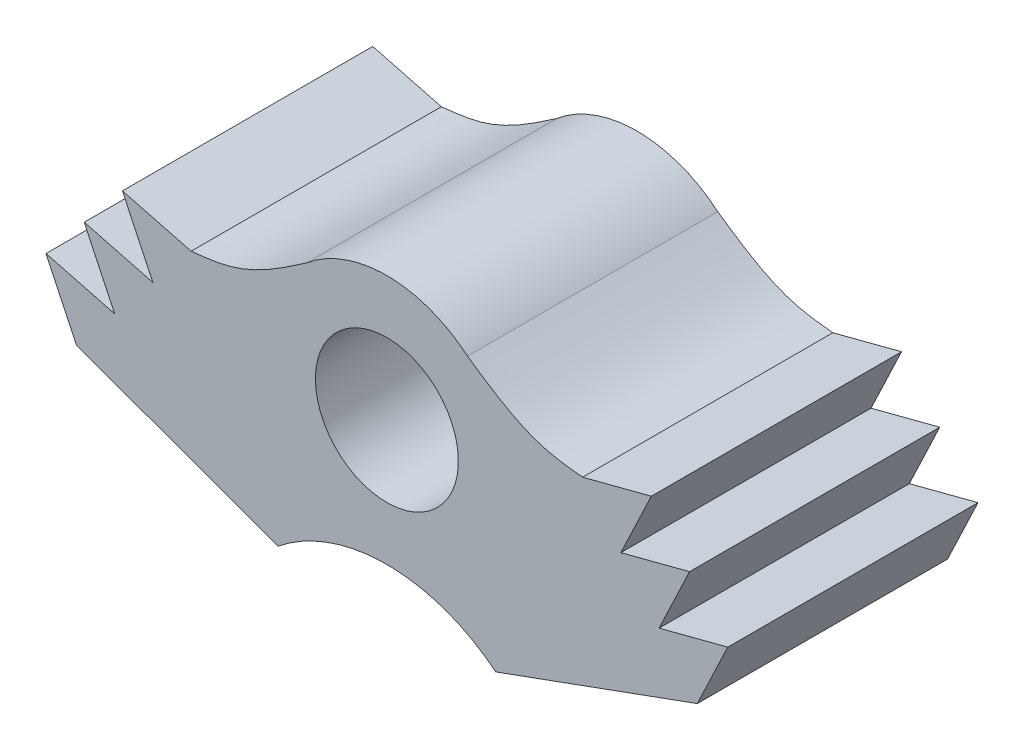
ISO-10303-21;
HEADER;
FILE_DESCRIPTION(('STEP AP214'),'2;1');
FILE_NAME('part.step','',(''),(''),'','','');
FILE_SCHEMA(('AUTOMOTIVE_DESIGN { 1 0 10303 214 1 1 1 1 }'));
ENDSEC;
DATA;
#1=APPLICATION_CONTEXT('core data for automotive mechanical design processes');
#2=APPLICATION_PROTOCOL_DEFINITION('international standard','automotive_design',2000,#1);
#3=PRODUCT_CONTEXT('',#1,'mechanical');
#4=PRODUCT('Part','Part','',(#3));
#5=PRODUCT_RELATED_PRODUCT_CATEGORY('part','',(#4));
#6=PRODUCT_DEFINITION_FORMATION('','',#4);
#7=PRODUCT_DEFINITION_CONTEXT('part definition',#1,'design');
#8=PRODUCT_DEFINITION('design','',#6,#7);
#9=PRODUCT_DEFINITION_SHAPE('','',#8);
#10=(LENGTH_UNIT() NAMED_UNIT(*) SI_UNIT(.MILLI.,.METRE.));
#11=(NAMED_UNIT(*) PLANE_ANGLE_UNIT() SI_UNIT($,.RADIAN.));
#12=(NAMED_UNIT(*) SI_UNIT($,.STERADIAN.) SOLID_ANGLE_UNIT());
#13=UNCERTAINTY_MEASURE_WITH_UNIT(LENGTH_MEASURE(1.E-05),#10,'distance_accuracy_value','');
#14=(GEOMETRIC_REPRESENTATION_CONTEXT(3) GLOBAL_UNCERTAINTY_ASSIGNED_CONTEXT((#13)) GLOBAL_UNIT_ASSIGNED_CONTEXT((#10,
#11,#12)) REPRESENTATION_CONTEXT('',''));
#15=CARTESIAN_POINT('',(0.,0.,0.));
#16=DIRECTION('',(0.,0.,1.));
#17=DIRECTION('',(1.,0.,0.));
#18=AXIS2_PLACEMENT_3D('',#15,#16,#17);
#19=CARTESIAN_POINT('',(0.,0.,7.));
#20=DIRECTION('',(0.,0.,1.));
#21=DIRECTION('',(1.,0.,0.));
#22=AXIS2_PLACEMENT_3D('',#19,#20,#21);
#23=PLANE('',#22);
#24=CARTESIAN_POINT('',(0.,0.,7.));
#25=DIRECTION('',(0.,0.,-1.));
#26=DIRECTION('',(1.,0.,0.));
#27=AXIS2_PLACEMENT_3D('',#24,#25,#26);
#28=CIRCLE('',#27,4.83630465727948);
#29=CARTESIAN_POINT('',(-3.04627929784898,3.75633134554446,7.));
#30=VERTEX_POINT('',#29);
#31=CARTESIAN_POINT('',(3.04627929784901,3.7563313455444,7.));
#32=VERTEX_POINT('',#31);
#33=EDGE_CURVE('E216',#30,#32,#28,.T.);
#34=ORIENTED_EDGE('',*,*,#33,.T.);
#35=DIRECTION('',(0.939692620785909,0.342020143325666,0.));
#36=VECTOR('',#35,1.);
#37=CARTESIAN_POINT('',(3.04627929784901,3.7563313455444,7.));
#38=LINE('',#37,#36);
#39=CARTESIAN_POINT('',(8.68443502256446,5.80845220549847,7.));
#40=VERTEX_POINT('',#39);
#41=EDGE_CURVE('E163',#32,#40,#38,.T.);
#42=ORIENTED_EDGE('',*,*,#41,.T.);
#43=DIRECTION('',(0.429064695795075,0.903273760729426,0.));
#44=VECTOR('',#43,1.);
#45=CARTESIAN_POINT('',(8.68443502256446,5.80845220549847,7.));
#46=LINE('',#45,#44);
#47=CARTESIAN_POINT('',(9.53645404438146,7.60213608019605,7.));
#48=VERTEX_POINT('',#47);
#49=EDGE_CURVE('E219',#40,#48,#46,.T.);
#50=ORIENTED_EDGE('',*,*,#49,.T.);
#51=DIRECTION('',(-0.967745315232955,-0.251930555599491,0.));
#52=VECTOR('',#51,1.);
#53=CARTESIAN_POINT('',(9.53645404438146,7.60213608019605,7.));
#54=LINE('',#53,#52);
#55=CARTESIAN_POINT('',(7.61474520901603,7.10186274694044,7.));
#56=VERTEX_POINT('',#55);
#57=EDGE_CURVE('E221',#48,#56,#54,.T.);
#58=ORIENTED_EDGE('',*,*,#57,.T.);
#59=DIRECTION('',(0.429064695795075,0.903273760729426,0.));
#60=VECTOR('',#59,1.);
#61=CARTESIAN_POINT('',(7.61474520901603,7.10186274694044,7.));
#62=LINE('',#61,#60);
#63=CARTESIAN_POINT('',(8.46676423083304,8.89554662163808,7.));
#64=VERTEX_POINT('',#63);
#65=EDGE_CURVE('E223',#56,#64,#62,.T.);
#66=ORIENTED_EDGE('',*,*,#65,.T.);
#67=DIRECTION('',(-0.967745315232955,-0.251930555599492,0.));
#68=VECTOR('',#67,1.);
#69=CARTESIAN_POINT('',(8.46676423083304,8.89554662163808,7.));
#70=LINE('',#69,#68);
#71=CARTESIAN_POINT('',(6.54505539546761,8.39527328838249,7.));
#72=VERTEX_POINT('',#71);
#73=EDGE_CURVE('E225',#64,#72,#70,.T.);
#74=ORIENTED_EDGE('',*,*,#73,.T.);
#75=DIRECTION('',(0.429064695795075,0.903273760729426,0.));
#76=VECTOR('',#75,1.);
#77=CARTESIAN_POINT('',(6.54505539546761,8.39527328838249,7.));
#78=LINE('',#77,#76);
#79=CARTESIAN_POINT('',(7.39707441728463,10.1889571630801,7.));
#80=VERTEX_POINT('',#79);
#81=EDGE_CURVE('E227',#72,#80,#78,.T.);
#82=ORIENTED_EDGE('',*,*,#81,.T.);
#83=DIRECTION('',(-0.967745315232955,-0.251930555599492,0.));
#84=VECTOR('',#83,1.);
#85=CARTESIAN_POINT('',(7.39707441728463,10.1889571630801,7.));
#86=LINE('',#85,#84);
#87=CARTESIAN_POINT('',(5.47536558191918,9.68868382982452,7.));
#88=VERTEX_POINT('',#87);
#89=EDGE_CURVE('E229',#80,#88,#86,.T.);
#90=ORIENTED_EDGE('',*,*,#89,.T.);
#91=CARTESIAN_POINT('',(5.47536558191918,9.68868382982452,7.));
#92=CARTESIAN_POINT('',(5.12775168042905,9.72572060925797,7.));
#93=CARTESIAN_POINT('',(3.9496177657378,9.85124575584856,7.));
#94=CARTESIAN_POINT('',(2.95621737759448,10.5322218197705,7.));
#95=CARTESIAN_POINT('',(2.2559244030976,11.012272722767,7.));
#96=B_SPLINE_CURVE_WITH_KNOTS('',3,(#91,#92,#93,#94,#95),.UNSPECIFIED.,.F.,.F.,(4,1,4),(0.,
0.295054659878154,1.),.UNSPECIFIED.);
#97=CARTESIAN_POINT('',(2.2559244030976,11.012272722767,7.));
#98=VERTEX_POINT('',#97);
#99=EDGE_CURVE('E231',#88,#98,#96,.T.);
#100=ORIENTED_EDGE('',*,*,#99,.T.);
#101=CARTESIAN_POINT('',(0.,8.33630465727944,7.));
#102=DIRECTION('',(0.,0.,1.));
#103=DIRECTION('',(1.,0.,0.));
#104=AXIS2_PLACEMENT_3D('',#101,#102,#103);
#105=CIRCLE('',#104,3.5);
#106=CARTESIAN_POINT('',(-2.25592440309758,11.0122727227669,7.));
#107=VERTEX_POINT('',#106);
#108=EDGE_CURVE('E236',#98,#107,#105,.T.);
#109=ORIENTED_EDGE('',*,*,#108,.T.);
#110=CARTESIAN_POINT('',(-2.25592440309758,11.0122727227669,7.));
#111=CARTESIAN_POINT('',(-2.95621737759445,10.5322218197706,7.));
#112=CARTESIAN_POINT('',(-3.94961776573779,9.85124575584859,7.));
#113=CARTESIAN_POINT('',(-5.12775168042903,9.72572060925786,7.));
#114=CARTESIAN_POINT('',(-5.47536558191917,9.68868382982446,7.));
#115=B_SPLINE_CURVE_WITH_KNOTS('',3,(#110,#111,#112,#113,#114),.UNSPECIFIED.,.F.,.F.,(4,1,4),
(0.,0.704945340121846,1.),.UNSPECIFIED.);
#116=CARTESIAN_POINT('',(-5.47536558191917,9.68868382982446,7.));
#117=VERTEX_POINT('',#116);
#118=EDGE_CURVE('E316',#107,#117,#115,.T.);
#119=ORIENTED_EDGE('',*,*,#118,.T.);
#120=DIRECTION('',(-0.967745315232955,0.251930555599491,0.));
#121=VECTOR('',#120,1.);
#122=CARTESIAN_POINT('',(-7.39707441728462,10.1889571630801,7.));
#123=LINE('',#122,#121);
#124=CARTESIAN_POINT('',(-7.39707441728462,10.1889571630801,7.));
#125=VERTEX_POINT('',#124);
#126=EDGE_CURVE('E321',#117,#125,#123,.T.);
#127=ORIENTED_EDGE('',*,*,#126,.T.);
#128=DIRECTION('',(0.429064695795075,-0.903273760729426,0.));
#129=VECTOR('',#128,1.);
#130=CARTESIAN_POINT('',(-6.5450553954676,8.39527328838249,7.));
#131=LINE('',#130,#129);
#132=CARTESIAN_POINT('',(-6.5450553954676,8.39527328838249,7.));
#133=VERTEX_POINT('',#132);
#134=EDGE_CURVE('E326',#125,#133,#131,.T.);
#135=ORIENTED_EDGE('',*,*,#134,.T.);
#136=DIRECTION('',(-0.967745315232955,0.251930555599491,0.));
#137=VECTOR('',#136,1.);
#138=CARTESIAN_POINT('',(-8.46676423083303,8.89554662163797,7.));
#139=LINE('',#138,#137);
#140=CARTESIAN_POINT('',(-8.46676423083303,8.89554662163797,7.));
#141=VERTEX_POINT('',#140);
#142=EDGE_CURVE('E328',#133,#141,#139,.T.);
#143=ORIENTED_EDGE('',*,*,#142,.T.);
#144=DIRECTION('',(0.429064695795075,-0.903273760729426,0.));
#145=VECTOR('',#144,1.);
#146=CARTESIAN_POINT('',(-7.61474520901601,7.10186274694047,7.));
#147=LINE('',#146,#145);
#148=CARTESIAN_POINT('',(-7.61474520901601,7.10186274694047,7.));
#149=VERTEX_POINT('',#148);
#150=EDGE_CURVE('E330',#141,#149,#147,.T.);
#151=ORIENTED_EDGE('',*,*,#150,.T.);
#152=DIRECTION('',(-0.967745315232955,0.251930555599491,0.));
#153=VECTOR('',#152,1.);
#154=CARTESIAN_POINT('',(-9.53645404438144,7.602136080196,7.));
#155=LINE('',#154,#153);
#156=CARTESIAN_POINT('',(-9.53645404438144,7.602136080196,7.));
#157=VERTEX_POINT('',#156);
#158=EDGE_CURVE('E332',#149,#157,#155,.T.);
#159=ORIENTED_EDGE('',*,*,#158,.T.);
#160=DIRECTION('',(0.429064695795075,-0.903273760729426,0.));
#161=VECTOR('',#160,1.);
#162=CARTESIAN_POINT('',(-8.68443502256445,5.80845220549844,7.));
#163=LINE('',#162,#161);
#164=CARTESIAN_POINT('',(-8.68443502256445,5.80845220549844,7.));
#165=VERTEX_POINT('',#164);
#166=EDGE_CURVE('E44',#157,#165,#163,.T.);
#167=ORIENTED_EDGE('',*,*,#166,.T.);
#168=DIRECTION('',(0.939692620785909,-0.342020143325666,0.));
#169=VECTOR('',#168,1.);
#170=CARTESIAN_POINT('',(-3.04627929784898,3.75633134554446,7.));
#171=LINE('',#170,#169);
#172=EDGE_CURVE('E39',#165,#30,#171,.T.);
#173=ORIENTED_EDGE('',*,*,#172,.T.);
#174=EDGE_LOOP('',(#34,#42,#50,#58,#66,#74,#82,#90,#100,#109,#119,#127,#135,#143,#151,#159,#167,#173));
#175=FACE_BOUND('',#174,.T.);
#176=CARTESIAN_POINT('',(0.,8.33630465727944,7.));
#177=DIRECTION('',(0.,0.,1.));
#178=DIRECTION('',(1.,0.,0.));
#179=AXIS2_PLACEMENT_3D('',#176,#177,#178);
#180=CIRCLE('',#179,2.);
#181=CARTESIAN_POINT('',(-1.99999999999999,8.33630465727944,7.));
#182=VERTEX_POINT('',#181);
#183=EDGE_CURVE('E168',#182,#182,#180,.T.);
#184=ORIENTED_EDGE('',*,*,#183,.F.);
#185=EDGE_LOOP('',(#184));
#186=FACE_BOUND('',#185,.T.);
#187=ADVANCED_FACE('F24',(#175,#186),#23,.T.);
#188=CARTESIAN_POINT('',(0.,0.,0.));
#189=DIRECTION('',(0.,0.,1.));
#190=DIRECTION('',(1.,0.,0.));
#191=AXIS2_PLACEMENT_3D('',#188,#189,#190);
#192=PLANE('',#191);
#193=CARTESIAN_POINT('',(0.,0.,0.));
#194=DIRECTION('',(0.,0.,-1.));
#195=DIRECTION('',(1.,0.,0.));
#196=AXIS2_PLACEMENT_3D('',#193,#194,#195);
#197=CIRCLE('',#196,4.83630465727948);
#198=CARTESIAN_POINT('',(-3.04627929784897,3.7563313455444,0.));
#199=VERTEX_POINT('',#198);
#200=CARTESIAN_POINT('',(3.046279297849,3.75633134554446,0.));
#201=VERTEX_POINT('',#200);
#202=EDGE_CURVE('E154',#199,#201,#197,.T.);
#203=ORIENTED_EDGE('',*,*,#202,.F.);
#204=DIRECTION('',(0.939692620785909,-0.342020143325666,0.));
#205=VECTOR('',#204,1.);
#206=CARTESIAN_POINT('',(-3.04627929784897,3.7563313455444,0.));
#207=LINE('',#206,#205);
#208=CARTESIAN_POINT('',(-8.68443502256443,5.80845220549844,0.));
#209=VERTEX_POINT('',#208);
#210=EDGE_CURVE('E214',#209,#199,#207,.T.);
#211=ORIENTED_EDGE('',*,*,#210,.F.);
#212=DIRECTION('',(0.429064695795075,-0.903273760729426,0.));
#213=VECTOR('',#212,1.);
#214=CARTESIAN_POINT('',(-8.68443502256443,5.80845220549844,0.));
#215=LINE('',#214,#213);
#216=CARTESIAN_POINT('',(-9.53645404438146,7.60213608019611,0.));
#217=VERTEX_POINT('',#216);
#218=EDGE_CURVE('E212',#217,#209,#215,.T.);
#219=ORIENTED_EDGE('',*,*,#218,.F.);
#220=DIRECTION('',(-0.967745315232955,0.251930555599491,0.));
#221=VECTOR('',#220,1.);
#222=CARTESIAN_POINT('',(-9.53645404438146,7.60213608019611,0.));
#223=LINE('',#222,#221);
#224=CARTESIAN_POINT('',(-7.61474520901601,7.1018627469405,0.));
#225=VERTEX_POINT('',#224);
#226=EDGE_CURVE('E210',#225,#217,#223,.T.);
#227=ORIENTED_EDGE('',*,*,#226,.F.);
#228=DIRECTION('',(0.429064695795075,-0.903273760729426,0.));
#229=VECTOR('',#228,1.);
#230=CARTESIAN_POINT('',(-7.61474520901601,7.1018627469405,0.));
#231=LINE('',#230,#229);
#232=CARTESIAN_POINT('',(-8.46676423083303,8.89554662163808,0.));
#233=VERTEX_POINT('',#232);
#234=EDGE_CURVE('E208',#233,#225,#231,.T.);
#235=ORIENTED_EDGE('',*,*,#234,.F.);
#236=DIRECTION('',(-0.967745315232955,0.251930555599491,0.));
#237=VECTOR('',#236,1.);
#238=CARTESIAN_POINT('',(-8.46676423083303,8.89554662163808,0.));
#239=LINE('',#238,#237);
#240=CARTESIAN_POINT('',(-6.5450553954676,8.39527328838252,0.));
#241=VERTEX_POINT('',#240);
#242=EDGE_CURVE('E206',#241,#233,#239,.T.);
#243=ORIENTED_EDGE('',*,*,#242,.F.);
#244=DIRECTION('',(0.429064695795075,-0.903273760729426,0.));
#245=VECTOR('',#244,1.);
#246=CARTESIAN_POINT('',(-6.5450553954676,8.39527328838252,0.));
#247=LINE('',#246,#245);
#248=CARTESIAN_POINT('',(-7.39707441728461,10.1889571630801,0.));
#249=VERTEX_POINT('',#248);
#250=EDGE_CURVE('E204',#249,#241,#247,.T.);
#251=ORIENTED_EDGE('',*,*,#250,.F.);
#252=DIRECTION('',(-0.967745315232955,0.251930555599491,0.));
#253=VECTOR('',#252,1.);
#254=CARTESIAN_POINT('',(-7.39707441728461,10.1889571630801,0.));
#255=LINE('',#254,#253);
#256=CARTESIAN_POINT('',(-5.47536558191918,9.68868382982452,0.));
#257=VERTEX_POINT('',#256);
#258=EDGE_CURVE('E199',#257,#249,#255,.T.);
#259=ORIENTED_EDGE('',*,*,#258,.F.);
#260=CARTESIAN_POINT('',(-2.25592440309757,11.0122727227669,0.));
#261=CARTESIAN_POINT('',(-2.95621737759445,10.5322218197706,0.));
#262=CARTESIAN_POINT('',(-3.94961776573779,9.85124575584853,0.));
#263=CARTESIAN_POINT('',(-5.12775168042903,9.72572060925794,0.));
#264=CARTESIAN_POINT('',(-5.47536558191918,9.68868382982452,0.));
#265=B_SPLINE_CURVE_WITH_KNOTS('',3,(#260,#261,#262,#263,#264),.UNSPECIFIED.,.F.,.F.,(4,1,4),
(0.,0.704945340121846,1.),.UNSPECIFIED.);
#266=CARTESIAN_POINT('',(-2.25592440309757,11.0122727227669,0.));
#267=VERTEX_POINT('',#266);
#268=EDGE_CURVE('E195',#267,#257,#265,.T.);
#269=ORIENTED_EDGE('',*,*,#268,.F.);
#270=CARTESIAN_POINT('',(0.,8.33630465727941,0.));
#271=DIRECTION('',(0.,0.,1.));
#272=DIRECTION('',(1.,0.,0.));
#273=AXIS2_PLACEMENT_3D('',#270,#271,#272);
#274=CIRCLE('',#273,3.5);
#275=CARTESIAN_POINT('',(2.25592440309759,11.0122727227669,0.));
#276=VERTEX_POINT('',#275);
#277=EDGE_CURVE('E190',#276,#267,#274,.T.);
#278=ORIENTED_EDGE('',*,*,#277,.F.);
#279=CARTESIAN_POINT('',(5.47536558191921,9.68868382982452,0.));
#280=CARTESIAN_POINT('',(5.12775168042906,9.72572060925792,0.));
#281=CARTESIAN_POINT('',(3.94961776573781,9.85124575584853,0.));
#282=CARTESIAN_POINT('',(2.95621737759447,10.5322218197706,0.));
#283=CARTESIAN_POINT('',(2.25592440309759,11.0122727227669,0.));
#284=B_SPLINE_CURVE_WITH_KNOTS('',3,(#279,#280,#281,#282,#283),.UNSPECIFIED.,.F.,.F.,(4,1,4),
(0.,0.295054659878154,1.),.UNSPECIFIED.);
#285=CARTESIAN_POINT('',(5.47536558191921,9.68868382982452,0.));
#286=VERTEX_POINT('',#285);
#287=EDGE_CURVE('E186',#286,#276,#284,.T.);
#288=ORIENTED_EDGE('',*,*,#287,.F.);
#289=DIRECTION('',(-0.967745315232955,-0.251930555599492,0.));
#290=VECTOR('',#289,1.);
#291=CARTESIAN_POINT('',(7.39707441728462,10.1889571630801,0.));
#292=LINE('',#291,#290);
#293=CARTESIAN_POINT('',(7.39707441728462,10.1889571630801,0.));
#294=VERTEX_POINT('',#293);
#295=EDGE_CURVE('E184',#294,#286,#292,.T.);
#296=ORIENTED_EDGE('',*,*,#295,.F.);
#297=DIRECTION('',(0.429064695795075,0.903273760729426,0.));
#298=VECTOR('',#297,1.);
#299=CARTESIAN_POINT('',(6.54505539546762,8.39527328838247,0.));
#300=LINE('',#299,#298);
#301=CARTESIAN_POINT('',(6.54505539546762,8.39527328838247,0.));
#302=VERTEX_POINT('',#301);
#303=EDGE_CURVE('E182',#302,#294,#300,.T.);
#304=ORIENTED_EDGE('',*,*,#303,.F.);
#305=DIRECTION('',(-0.967745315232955,-0.251930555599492,0.));
#306=VECTOR('',#305,1.);
#307=CARTESIAN_POINT('',(8.46676423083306,8.89554662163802,0.));
#308=LINE('',#307,#306);
#309=CARTESIAN_POINT('',(8.46676423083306,8.89554662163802,0.));
#310=VERTEX_POINT('',#309);
#311=EDGE_CURVE('E180',#310,#302,#308,.T.);
#312=ORIENTED_EDGE('',*,*,#311,.F.);
#313=DIRECTION('',(0.429064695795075,0.903273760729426,0.));
#314=VECTOR('',#313,1.);
#315=CARTESIAN_POINT('',(7.61474520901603,7.10186274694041,0.));
#316=LINE('',#315,#314);
#317=CARTESIAN_POINT('',(7.61474520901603,7.10186274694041,0.));
#318=VERTEX_POINT('',#317);
#319=EDGE_CURVE('E178',#318,#310,#316,.T.);
#320=ORIENTED_EDGE('',*,*,#319,.F.);
#321=DIRECTION('',(-0.967745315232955,-0.251930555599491,0.));
#322=VECTOR('',#321,1.);
#323=CARTESIAN_POINT('',(9.53645404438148,7.60213608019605,0.));
#324=LINE('',#323,#322);
#325=CARTESIAN_POINT('',(9.53645404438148,7.60213608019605,0.));
#326=VERTEX_POINT('',#325);
#327=EDGE_CURVE('E176',#326,#318,#324,.T.);
#328=ORIENTED_EDGE('',*,*,#327,.F.);
#329=DIRECTION('',(0.429064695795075,0.903273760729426,0.));
#330=VECTOR('',#329,1.);
#331=CARTESIAN_POINT('',(8.68443502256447,5.80845220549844,0.));
#332=LINE('',#331,#330);
#333=CARTESIAN_POINT('',(8.68443502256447,5.80845220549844,0.));
#334=VERTEX_POINT('',#333);
#335=EDGE_CURVE('E156',#334,#326,#332,.T.);
#336=ORIENTED_EDGE('',*,*,#335,.F.);
#337=DIRECTION('',(0.939692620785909,0.342020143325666,0.));
#338=VECTOR('',#337,1.);
#339=CARTESIAN_POINT('',(3.046279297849,3.75633134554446,0.));
#340=LINE('',#339,#338);
#341=EDGE_CURVE('E149',#201,#334,#340,.T.);
#342=ORIENTED_EDGE('',*,*,#341,.F.);
#343=EDGE_LOOP('',(#203,#211,#219,#227,#235,#243,#251,#259,#269,#278,#288,#296,#304,#312,#320,
#328,#336,#342));
#344=FACE_BOUND('',#343,.T.);
#345=CARTESIAN_POINT('',(0.,8.33630465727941,0.));
#346=DIRECTION('',(0.,0.,1.));
#347=DIRECTION('',(1.,0.,0.));
#348=AXIS2_PLACEMENT_3D('',#345,#346,#347);
#349=CIRCLE('',#348,2.);
#350=CARTESIAN_POINT('',(-1.99999999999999,8.33630465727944,0.));
#351=VERTEX_POINT('',#350);
#352=EDGE_CURVE('E171',#351,#351,#349,.T.);
#353=ORIENTED_EDGE('',*,*,#352,.T.);
#354=EDGE_LOOP('',(#353));
#355=FACE_BOUND('',#354,.T.);
#356=ADVANCED_FACE('F150',(#344,#355),#192,.F.);
#357=CARTESIAN_POINT('',(0.,0.,7.));
#358=DIRECTION('',(0.,0.,-1.));
#359=DIRECTION('',(-1.,0.,0.));
#360=AXIS2_PLACEMENT_3D('',#357,#358,#359);
#361=CYLINDRICAL_SURFACE('',#360,4.83630465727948);
#362=ORIENTED_EDGE('',*,*,#202,.T.);
#363=DIRECTION('',(0.,0.,-1.));
#364=VECTOR('',#363,1.);
#365=CARTESIAN_POINT('',(3.04627929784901,3.7563313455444,7.));
#366=LINE('',#365,#364);
#367=EDGE_CURVE('E11',#32,#201,#366,.T.);
#368=ORIENTED_EDGE('',*,*,#367,.F.);
#369=ORIENTED_EDGE('',*,*,#33,.F.);
#370=DIRECTION('',(0.,0.,-1.));
#371=VECTOR('',#370,1.);
#372=CARTESIAN_POINT('',(-3.04627929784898,3.75633134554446,7.));
#373=LINE('',#372,#371);
#374=EDGE_CURVE('E167',#30,#199,#373,.T.);
#375=ORIENTED_EDGE('',*,*,#374,.T.);
#376=EDGE_LOOP('',(#362,#368,#369,#375));
#377=FACE_BOUND('',#376,.T.);
#378=ADVANCED_FACE('F26',(#377),#361,.F.);
#379=CARTESIAN_POINT('',(3.04627929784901,3.7563313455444,7.));
#380=DIRECTION('',(-0.342020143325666,0.939692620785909,0.));
#381=DIRECTION('',(-0.939692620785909,-0.342020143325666,0.));
#382=AXIS2_PLACEMENT_3D('',#379,#380,#381);
#383=PLANE('',#382);
#384=ORIENTED_EDGE('',*,*,#341,.T.);
#385=DIRECTION('',(0.,0.,-1.));
#386=VECTOR('',#385,1.);
#387=CARTESIAN_POINT('',(8.68443502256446,5.80845220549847,7.));
#388=LINE('',#387,#386);
#389=EDGE_CURVE('E32',#40,#334,#388,.T.);
#390=ORIENTED_EDGE('',*,*,#389,.F.);
#391=ORIENTED_EDGE('',*,*,#41,.F.);
#392=ORIENTED_EDGE('',*,*,#367,.T.);
#393=EDGE_LOOP('',(#384,#390,#391,#392));
#394=FACE_BOUND('',#393,.T.);
#395=ADVANCED_FACE('F162',(#394),#383,.F.);
#396=CARTESIAN_POINT('',(8.68443502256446,5.80845220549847,7.));
#397=DIRECTION('',(-0.903273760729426,0.429064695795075,0.));
#398=DIRECTION('',(-0.429064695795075,-0.903273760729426,0.));
#399=AXIS2_PLACEMENT_3D('',#396,#397,#398);
#400=PLANE('',#399);
#401=ORIENTED_EDGE('',*,*,#335,.T.);
#402=DIRECTION('',(0.,0.,-1.));
#403=VECTOR('',#402,1.);
#404=CARTESIAN_POINT('',(9.53645404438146,7.60213608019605,7.));
#405=LINE('',#404,#403);
#406=EDGE_CURVE('E379',#48,#326,#405,.T.);
#407=ORIENTED_EDGE('',*,*,#406,.F.);
#408=ORIENTED_EDGE('',*,*,#49,.F.);
#409=ORIENTED_EDGE('',*,*,#389,.T.);
#410=EDGE_LOOP('',(#401,#407,#408,#409));
#411=FACE_BOUND('',#410,.T.);
#412=ADVANCED_FACE('F268',(#411),#400,.F.);
#413=CARTESIAN_POINT('',(9.53645404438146,7.60213608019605,7.));
#414=DIRECTION('',(0.251930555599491,-0.967745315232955,0.));
#415=DIRECTION('',(0.967745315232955,0.251930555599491,0.));
#416=AXIS2_PLACEMENT_3D('',#413,#414,#415);
#417=PLANE('',#416);
#418=ORIENTED_EDGE('',*,*,#327,.T.);
#419=DIRECTION('',(0.,0.,-1.));
#420=VECTOR('',#419,1.);
#421=CARTESIAN_POINT('',(7.61474520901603,7.10186274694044,7.));
#422=LINE('',#421,#420);
#423=EDGE_CURVE('E376',#56,#318,#422,.T.);
#424=ORIENTED_EDGE('',*,*,#423,.F.);
#425=ORIENTED_EDGE('',*,*,#57,.F.);
#426=ORIENTED_EDGE('',*,*,#406,.T.);
#427=EDGE_LOOP('',(#418,#424,#425,#426));
#428=FACE_BOUND('',#427,.T.);
#429=ADVANCED_FACE('F264',(#428),#417,.F.);
#430=CARTESIAN_POINT('',(7.61474520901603,7.10186274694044,7.));
#431=DIRECTION('',(-0.903273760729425,0.429064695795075,0.));
#432=DIRECTION('',(-0.429064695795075,-0.903273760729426,0.));
#433=AXIS2_PLACEMENT_3D('',#430,#431,#432);
#434=PLANE('',#433);
#435=ORIENTED_EDGE('',*,*,#319,.T.);
#436=DIRECTION('',(0.,0.,-1.));
#437=VECTOR('',#436,1.);
#438=CARTESIAN_POINT('',(8.46676423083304,8.89554662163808,7.));
#439=LINE('',#438,#437);
#440=EDGE_CURVE('E373',#64,#310,#439,.T.);
#441=ORIENTED_EDGE('',*,*,#440,.F.);
#442=ORIENTED_EDGE('',*,*,#65,.F.);
#443=ORIENTED_EDGE('',*,*,#423,.T.);
#444=EDGE_LOOP('',(#435,#441,#442,#443));
#445=FACE_BOUND('',#444,.T.);
#446=ADVANCED_FACE('F260',(#445),#434,.F.);
#447=CARTESIAN_POINT('',(8.46676423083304,8.89554662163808,7.));
#448=DIRECTION('',(0.251930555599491,-0.967745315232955,0.));
#449=DIRECTION('',(0.967745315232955,0.251930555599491,0.));
#450=AXIS2_PLACEMENT_3D('',#447,#448,#449);
#451=PLANE('',#450);
#452=ORIENTED_EDGE('',*,*,#311,.T.);
#453=DIRECTION('',(0.,0.,-1.));
#454=VECTOR('',#453,1.);
#455=CARTESIAN_POINT('',(6.54505539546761,8.39527328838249,7.));
#456=LINE('',#455,#454);
#457=EDGE_CURVE('E370',#72,#302,#456,.T.);
#458=ORIENTED_EDGE('',*,*,#457,.F.);
#459=ORIENTED_EDGE('',*,*,#73,.F.);
#460=ORIENTED_EDGE('',*,*,#440,.T.);
#461=EDGE_LOOP('',(#452,#458,#459,#460));
#462=FACE_BOUND('',#461,.T.);
#463=ADVANCED_FACE('F256',(#462),#451,.F.);
#464=CARTESIAN_POINT('',(6.54505539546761,8.39527328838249,7.));
#465=DIRECTION('',(-0.903273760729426,0.429064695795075,0.));
#466=DIRECTION('',(-0.429064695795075,-0.903273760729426,0.));
#467=AXIS2_PLACEMENT_3D('',#464,#465,#466);
#468=PLANE('',#467);
#469=ORIENTED_EDGE('',*,*,#303,.T.);
#470=DIRECTION('',(0.,0.,-1.));
#471=VECTOR('',#470,1.);
#472=CARTESIAN_POINT('',(7.39707441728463,10.1889571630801,7.));
#473=LINE('',#472,#471);
#474=EDGE_CURVE('E367',#80,#294,#473,.T.);
#475=ORIENTED_EDGE('',*,*,#474,.F.);
#476=ORIENTED_EDGE('',*,*,#81,.F.);
#477=ORIENTED_EDGE('',*,*,#457,.T.);
#478=EDGE_LOOP('',(#469,#475,#476,#477));
#479=FACE_BOUND('',#478,.T.);
#480=ADVANCED_FACE('F252',(#479),#468,.F.);
#481=CARTESIAN_POINT('',(7.39707441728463,10.1889571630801,7.));
#482=DIRECTION('',(0.251930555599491,-0.967745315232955,0.));
#483=DIRECTION('',(0.967745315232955,0.251930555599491,0.));
#484=AXIS2_PLACEMENT_3D('',#481,#482,#483);
#485=PLANE('',#484);
#486=ORIENTED_EDGE('',*,*,#295,.T.);
#487=DIRECTION('',(0.,0.,-1.));
#488=VECTOR('',#487,1.);
#489=CARTESIAN_POINT('',(5.47536558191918,9.68868382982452,7.));
#490=LINE('',#489,#488);
#491=EDGE_CURVE('E364',#88,#286,#490,.T.);
#492=ORIENTED_EDGE('',*,*,#491,.F.);
#493=ORIENTED_EDGE('',*,*,#89,.F.);
#494=ORIENTED_EDGE('',*,*,#474,.T.);
#495=EDGE_LOOP('',(#486,#492,#493,#494));
#496=FACE_BOUND('',#495,.T.);
#497=ADVANCED_FACE('F247',(#496),#485,.F.);
#498=DIRECTION('',(0.,0.,-1.));
#499=VECTOR('',#498,1.);
#500=SURFACE_OF_LINEAR_EXTRUSION('',#96,#499);
#501=ORIENTED_EDGE('',*,*,#287,.T.);
#502=DIRECTION('',(0.,0.,-1.));
#503=VECTOR('',#502,1.);
#504=CARTESIAN_POINT('',(2.2559244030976,11.012272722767,7.));
#505=LINE('',#504,#503);
#506=EDGE_CURVE('E361',#98,#276,#505,.T.);
#507=ORIENTED_EDGE('',*,*,#506,.F.);
#508=ORIENTED_EDGE('',*,*,#99,.F.);
#509=ORIENTED_EDGE('',*,*,#491,.T.);
#510=EDGE_LOOP('',(#501,#507,#508,#509));
#511=FACE_BOUND('',#510,.T.);
#512=ADVANCED_FACE('F242',(#511),#500,.F.);
#513=CARTESIAN_POINT('',(0.,8.33630465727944,7.));
#514=DIRECTION('',(0.,0.,-1.));
#515=DIRECTION('',(-1.,0.,0.));
#516=AXIS2_PLACEMENT_3D('',#513,#514,#515);
#517=CYLINDRICAL_SURFACE('',#516,3.5);
#518=ORIENTED_EDGE('',*,*,#277,.T.);
#519=DIRECTION('',(0.,0.,-1.));
#520=VECTOR('',#519,1.);
#521=CARTESIAN_POINT('',(-2.25592440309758,11.0122727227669,7.));
#522=LINE('',#521,#520);
#523=EDGE_CURVE('E358',#107,#267,#522,.T.);
#524=ORIENTED_EDGE('',*,*,#523,.F.);
#525=ORIENTED_EDGE('',*,*,#108,.F.);
#526=ORIENTED_EDGE('',*,*,#506,.T.);
#527=EDGE_LOOP('',(#518,#524,#525,#526));
#528=FACE_BOUND('',#527,.T.);
#529=ADVANCED_FACE('F246',(#528),#517,.T.);
#530=DIRECTION('',(0.,0.,-1.));
#531=VECTOR('',#530,1.);
#532=SURFACE_OF_LINEAR_EXTRUSION('',#115,#531);
#533=ORIENTED_EDGE('',*,*,#268,.T.);
#534=DIRECTION('',(0.,0.,-1.));
#535=VECTOR('',#534,1.);
#536=CARTESIAN_POINT('',(-5.47536558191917,9.68868382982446,7.));
#537=LINE('',#536,#535);
#538=EDGE_CURVE('E355',#117,#257,#537,.T.);
#539=ORIENTED_EDGE('',*,*,#538,.F.);
#540=ORIENTED_EDGE('',*,*,#118,.F.);
#541=ORIENTED_EDGE('',*,*,#523,.T.);
#542=EDGE_LOOP('',(#533,#539,#540,#541));
#543=FACE_BOUND('',#542,.T.);
#544=ADVANCED_FACE('F312',(#543),#532,.F.);
#545=CARTESIAN_POINT('',(-7.39707441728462,10.1889571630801,7.));
#546=DIRECTION('',(-0.251930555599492,-0.967745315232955,0.));
#547=DIRECTION('',(0.967745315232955,-0.251930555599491,0.));
#548=AXIS2_PLACEMENT_3D('',#545,#546,#547);
#549=PLANE('',#548);
#550=ORIENTED_EDGE('',*,*,#258,.T.);
#551=DIRECTION('',(0.,0.,-1.));
#552=VECTOR('',#551,1.);
#553=CARTESIAN_POINT('',(-7.39707441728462,10.1889571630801,7.));
#554=LINE('',#553,#552);
#555=EDGE_CURVE('E352',#125,#249,#554,.T.);
#556=ORIENTED_EDGE('',*,*,#555,.F.);
#557=ORIENTED_EDGE('',*,*,#126,.F.);
#558=ORIENTED_EDGE('',*,*,#538,.T.);
#559=EDGE_LOOP('',(#550,#556,#557,#558));
#560=FACE_BOUND('',#559,.T.);
#561=ADVANCED_FACE('F309',(#560),#549,.F.);
#562=CARTESIAN_POINT('',(-6.5450553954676,8.39527328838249,7.));
#563=DIRECTION('',(0.903273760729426,0.429064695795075,0.));
#564=DIRECTION('',(-0.429064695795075,0.903273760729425,0.));
#565=AXIS2_PLACEMENT_3D('',#562,#563,#564);
#566=PLANE('',#565);
#567=ORIENTED_EDGE('',*,*,#250,.T.);
#568=DIRECTION('',(0.,0.,-1.));
#569=VECTOR('',#568,1.);
#570=CARTESIAN_POINT('',(-6.5450553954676,8.39527328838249,7.));
#571=LINE('',#570,#569);
#572=EDGE_CURVE('E349',#133,#241,#571,.T.);
#573=ORIENTED_EDGE('',*,*,#572,.F.);
#574=ORIENTED_EDGE('',*,*,#134,.F.);
#575=ORIENTED_EDGE('',*,*,#555,.T.);
#576=EDGE_LOOP('',(#567,#573,#574,#575));
#577=FACE_BOUND('',#576,.T.);
#578=ADVANCED_FACE('F305',(#577),#566,.F.);
#579=CARTESIAN_POINT('',(-8.46676423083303,8.89554662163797,7.));
#580=DIRECTION('',(-0.251930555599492,-0.967745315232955,0.));
#581=DIRECTION('',(0.967745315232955,-0.251930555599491,0.));
#582=AXIS2_PLACEMENT_3D('',#579,#580,#581);
#583=PLANE('',#582);
#584=ORIENTED_EDGE('',*,*,#242,.T.);
#585=DIRECTION('',(0.,0.,-1.));
#586=VECTOR('',#585,1.);
#587=CARTESIAN_POINT('',(-8.46676423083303,8.89554662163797,7.));
#588=LINE('',#587,#586);
#589=EDGE_CURVE('E346',#141,#233,#588,.T.);
#590=ORIENTED_EDGE('',*,*,#589,.F.);
#591=ORIENTED_EDGE('',*,*,#142,.F.);
#592=ORIENTED_EDGE('',*,*,#572,.T.);
#593=EDGE_LOOP('',(#584,#590,#591,#592));
#594=FACE_BOUND('',#593,.T.);
#595=ADVANCED_FACE('F301',(#594),#583,.F.);
#596=CARTESIAN_POINT('',(-7.61474520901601,7.10186274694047,7.));
#597=DIRECTION('',(0.903273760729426,0.429064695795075,0.));
#598=DIRECTION('',(-0.429064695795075,0.903273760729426,0.));
#599=AXIS2_PLACEMENT_3D('',#596,#597,#598);
#600=PLANE('',#599);
#601=ORIENTED_EDGE('',*,*,#234,.T.);
#602=DIRECTION('',(0.,0.,-1.));
#603=VECTOR('',#602,1.);
#604=CARTESIAN_POINT('',(-7.61474520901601,7.10186274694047,7.));
#605=LINE('',#604,#603);
#606=EDGE_CURVE('E343',#149,#225,#605,.T.);
#607=ORIENTED_EDGE('',*,*,#606,.F.);
#608=ORIENTED_EDGE('',*,*,#150,.F.);
#609=ORIENTED_EDGE('',*,*,#589,.T.);
#610=EDGE_LOOP('',(#601,#607,#608,#609));
#611=FACE_BOUND('',#610,.T.);
#612=ADVANCED_FACE('F297',(#611),#600,.F.);
#613=CARTESIAN_POINT('',(-9.53645404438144,7.602136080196,7.));
#614=DIRECTION('',(-0.251930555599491,-0.967745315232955,0.));
#615=DIRECTION('',(0.967745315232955,-0.251930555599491,0.));
#616=AXIS2_PLACEMENT_3D('',#613,#614,#615);
#617=PLANE('',#616);
#618=ORIENTED_EDGE('',*,*,#226,.T.);
#619=DIRECTION('',(0.,0.,-1.));
#620=VECTOR('',#619,1.);
#621=CARTESIAN_POINT('',(-9.53645404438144,7.602136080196,7.));
#622=LINE('',#621,#620);
#623=EDGE_CURVE('E340',#157,#217,#622,.T.);
#624=ORIENTED_EDGE('',*,*,#623,.F.);
#625=ORIENTED_EDGE('',*,*,#158,.F.);
#626=ORIENTED_EDGE('',*,*,#606,.T.);
#627=EDGE_LOOP('',(#618,#624,#625,#626));
#628=FACE_BOUND('',#627,.T.);
#629=ADVANCED_FACE('F293',(#628),#617,.F.);
#630=CARTESIAN_POINT('',(-8.68443502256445,5.80845220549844,7.));
#631=DIRECTION('',(0.903273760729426,0.429064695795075,0.));
#632=DIRECTION('',(-0.429064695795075,0.903273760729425,0.));
#633=AXIS2_PLACEMENT_3D('',#630,#631,#632);
#634=PLANE('',#633);
#635=ORIENTED_EDGE('',*,*,#218,.T.);
#636=DIRECTION('',(0.,0.,-1.));
#637=VECTOR('',#636,1.);
#638=CARTESIAN_POINT('',(-8.68443502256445,5.80845220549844,7.));
#639=LINE('',#638,#637);
#640=EDGE_CURVE('E337',#165,#209,#639,.T.);
#641=ORIENTED_EDGE('',*,*,#640,.F.);
#642=ORIENTED_EDGE('',*,*,#166,.F.);
#643=ORIENTED_EDGE('',*,*,#623,.T.);
#644=EDGE_LOOP('',(#635,#641,#642,#643));
#645=FACE_BOUND('',#644,.T.);
#646=ADVANCED_FACE('F289',(#645),#634,.F.);
#647=CARTESIAN_POINT('',(-3.04627929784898,3.75633134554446,7.));
#648=DIRECTION('',(0.342020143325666,0.939692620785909,0.));
#649=DIRECTION('',(-0.939692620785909,0.342020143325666,0.));
#650=AXIS2_PLACEMENT_3D('',#647,#648,#649);
#651=PLANE('',#650);
#652=ORIENTED_EDGE('',*,*,#210,.T.);
#653=ORIENTED_EDGE('',*,*,#374,.F.);
#654=ORIENTED_EDGE('',*,*,#172,.F.);
#655=ORIENTED_EDGE('',*,*,#640,.T.);
#656=EDGE_LOOP('',(#652,#653,#654,#655));
#657=FACE_BOUND('',#656,.T.);
#658=ADVANCED_FACE('F285',(#657),#651,.F.);
#659=CARTESIAN_POINT('',(0.,8.33630465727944,7.));
#660=DIRECTION('',(0.,0.,-1.));
#661=DIRECTION('',(-1.,0.,0.));
#662=AXIS2_PLACEMENT_3D('',#659,#660,#661);
#663=CYLINDRICAL_SURFACE('',#662,2.);
#664=CARTESIAN_POINT('',(-1.99999999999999,8.33630465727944,7.));
#665=CARTESIAN_POINT('',(-1.99999999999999,8.33630465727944,6.92708333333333));
#666=CARTESIAN_POINT('',(-1.99999999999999,8.33630465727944,6.85416666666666));
#667=CARTESIAN_POINT('',(-1.99999999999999,8.33630465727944,6.70833333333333));
#668=CARTESIAN_POINT('',(-1.99999999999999,8.33630465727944,6.63541666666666));
#669=CARTESIAN_POINT('',(-1.99999999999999,8.33630465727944,6.48958333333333));
#670=CARTESIAN_POINT('',(-1.99999999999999,8.33630465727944,6.41666666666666));
#671=CARTESIAN_POINT('',(-1.99999999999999,8.33630465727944,6.27083333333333));
#672=CARTESIAN_POINT('',(-1.99999999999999,8.33630465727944,6.19791666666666));
#673=CARTESIAN_POINT('',(-1.99999999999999,8.33630465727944,6.05208333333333));
#674=CARTESIAN_POINT('',(-1.99999999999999,8.33630465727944,5.97916666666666));
#675=CARTESIAN_POINT('',(-1.99999999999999,8.33630465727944,5.83333333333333));
#676=CARTESIAN_POINT('',(-1.99999999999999,8.33630465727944,5.76041666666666));
#677=CARTESIAN_POINT('',(-1.99999999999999,8.33630465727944,5.61458333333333));
#678=CARTESIAN_POINT('',(-1.99999999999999,8.33630465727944,5.54166666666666));
#679=CARTESIAN_POINT('',(-1.99999999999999,8.33630465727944,5.39583333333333));
#680=CARTESIAN_POINT('',(-1.99999999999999,8.33630465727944,5.32291666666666));
#681=CARTESIAN_POINT('',(-1.99999999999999,8.33630465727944,5.17708333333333));
#682=CARTESIAN_POINT('',(-1.99999999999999,8.33630465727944,5.10416666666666));
#683=CARTESIAN_POINT('',(-1.99999999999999,8.33630465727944,4.95833333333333));
#684=CARTESIAN_POINT('',(-1.99999999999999,8.33630465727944,4.88541666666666));
#685=CARTESIAN_POINT('',(-1.99999999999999,8.33630465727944,4.73958333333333));
#686=CARTESIAN_POINT('',(-1.99999999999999,8.33630465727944,4.66666666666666));
#687=CARTESIAN_POINT('',(-1.99999999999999,8.33630465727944,4.52083333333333));
#688=CARTESIAN_POINT('',(-1.99999999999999,8.33630465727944,4.44791666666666));
#689=CARTESIAN_POINT('',(-1.99999999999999,8.33630465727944,4.30208333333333));
#690=CARTESIAN_POINT('',(-1.99999999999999,8.33630465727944,4.22916666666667));
#691=CARTESIAN_POINT('',(-1.99999999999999,8.33630465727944,4.08333333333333));
#692=CARTESIAN_POINT('',(-1.99999999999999,8.33630465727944,4.01041666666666));
#693=CARTESIAN_POINT('',(-1.99999999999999,8.33630465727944,3.86458333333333));
#694=CARTESIAN_POINT('',(-1.99999999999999,8.33630465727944,3.79166666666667));
#695=CARTESIAN_POINT('',(-1.99999999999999,8.33630465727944,3.64583333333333));
#696=CARTESIAN_POINT('',(-1.99999999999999,8.33630465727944,3.57291666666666));
#697=CARTESIAN_POINT('',(-1.99999999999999,8.33630465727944,3.42708333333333));
#698=CARTESIAN_POINT('',(-1.99999999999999,8.33630465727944,3.35416666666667));
#699=CARTESIAN_POINT('',(-1.99999999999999,8.33630465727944,3.20833333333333));
#700=CARTESIAN_POINT('',(-1.99999999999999,8.33630465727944,3.13541666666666));
#701=CARTESIAN_POINT('',(-1.99999999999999,8.33630465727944,2.98958333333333));
#702=CARTESIAN_POINT('',(-1.99999999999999,8.33630465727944,2.91666666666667));
#703=CARTESIAN_POINT('',(-1.99999999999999,8.33630465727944,2.77083333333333));
#704=CARTESIAN_POINT('',(-1.99999999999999,8.33630465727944,2.69791666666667));
#705=CARTESIAN_POINT('',(-1.99999999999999,8.33630465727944,2.55208333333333));
#706=CARTESIAN_POINT('',(-1.99999999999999,8.33630465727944,2.47916666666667));
#707=CARTESIAN_POINT('',(-1.99999999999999,8.33630465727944,2.33333333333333));
#708=CARTESIAN_POINT('',(-1.99999999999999,8.33630465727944,2.26041666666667));
#709=CARTESIAN_POINT('',(-1.99999999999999,8.33630465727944,2.11458333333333));
#710=CARTESIAN_POINT('',(-1.99999999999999,8.33630465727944,2.04166666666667));
#711=CARTESIAN_POINT('',(-1.99999999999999,8.33630465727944,1.89583333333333));
#712=CARTESIAN_POINT('',(-1.99999999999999,8.33630465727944,1.82291666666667));
#713=CARTESIAN_POINT('',(-1.99999999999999,8.33630465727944,1.67708333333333));
#714=CARTESIAN_POINT('',(-1.99999999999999,8.33630465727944,1.60416666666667));
#715=CARTESIAN_POINT('',(-1.99999999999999,8.33630465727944,1.45833333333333));
#716=CARTESIAN_POINT('',(-1.99999999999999,8.33630465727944,1.38541666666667));
#717=CARTESIAN_POINT('',(-1.99999999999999,8.33630465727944,1.23958333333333));
#718=CARTESIAN_POINT('',(-1.99999999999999,8.33630465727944,1.16666666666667));
#719=CARTESIAN_POINT('',(-1.99999999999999,8.33630465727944,1.02083333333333));
#720=CARTESIAN_POINT('',(-1.99999999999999,8.33630465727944,0.947916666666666));
#721=CARTESIAN_POINT('',(-1.99999999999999,8.33630465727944,0.802083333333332));
#722=CARTESIAN_POINT('',(-1.99999999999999,8.33630465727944,0.729166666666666));
#723=CARTESIAN_POINT('',(-1.99999999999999,8.33630465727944,0.583333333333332));
#724=CARTESIAN_POINT('',(-1.99999999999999,8.33630465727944,0.510416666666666));
#725=CARTESIAN_POINT('',(-1.99999999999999,8.33630465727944,0.364583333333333));
#726=CARTESIAN_POINT('',(-1.99999999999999,8.33630465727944,0.291666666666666));
#727=CARTESIAN_POINT('',(-1.99999999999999,8.33630465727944,0.145833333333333));
#728=CARTESIAN_POINT('',(-1.99999999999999,8.33630465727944,0.0729166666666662));
#729=CARTESIAN_POINT('',(-1.99999999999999,8.33630465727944,0.));
#730=B_SPLINE_CURVE_WITH_KNOTS('',3,(#664,#665,#666,#667,#668,#669,#670,#671,#672,#673,#674,
#675,#676,#677,#678,#679,#680,#681,#682,#683,#684,#685,#686,#687,#688,#689,#690,#691,#692,#693,
#694,#695,#696,#697,#698,#699,#700,#701,#702,#703,#704,#705,#706,#707,#708,#709,#710,#711,#712,
#713,#714,#715,#716,#717,#718,#719,#720,#721,#722,#723,#724,#725,#726,#727,#728,#729),
.UNSPECIFIED.,.F.,.F.,(4,2,2,2,2,2,2,2,2,2,2,2,2,2,2,2,2,2,2,2,2,2,2,2,2,2,2,2,2,2,2,2,4),(0.,
0.21875,0.4375,0.656250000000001,0.875,1.09375,1.3125,1.53125,1.75,1.96875,2.1875,2.40625,2.625,
2.84375,3.0625,3.28125,3.5,3.71875,3.9375,4.15625,4.375,4.59375,4.8125,5.03125,5.25,5.46875,
5.6875,5.90625,6.125,6.34375,6.5625,6.78125,7.),.UNSPECIFIED.);
#731=EDGE_CURVE('BSEAM288',#182,#351,#730,.T.);
#732=ORIENTED_EDGE('',*,*,#183,.T.);
#733=ORIENTED_EDGE('',*,*,#352,.F.);
#734=ORIENTED_EDGE('',*,*,#731,.T.);
#735=ORIENTED_EDGE('',*,*,#731,.F.);
#736=EDGE_LOOP('',(#732,#734,#733,#735));
#737=FACE_BOUND('',#736,.T.);
#738=ADVANCED_FACE('F288',(#737),#663,.F.);
#739=CLOSED_SHELL('',(#187,#356,#378,#395,#412,#429,#446,#463,#480,#497,#512,#529,#544,#561,
#578,#595,#612,#629,#646,#658,#738));
#740=MANIFOLD_SOLID_BREP('B2',#739);
#741=ADVANCED_BREP_SHAPE_REPRESENTATION('',(#18,#740),#14);
#742=SHAPE_DEFINITION_REPRESENTATION(#9,#741);
ENDSEC;
END-ISO-10303-21;
